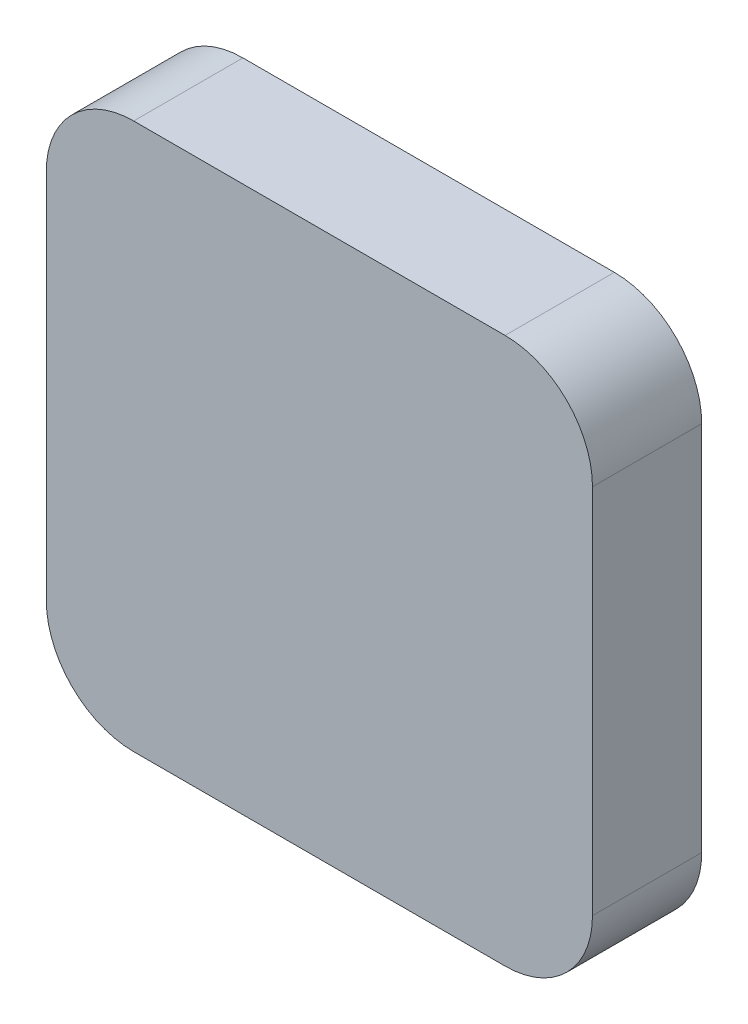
from build123d import *

# Parameters (mm, degrees)
ESQUISSE1_W      = 25
ESQUISSE1_H      = 25
EXTRUSION1_DEPTH = 5
CONG_1_R         = 4


with BuildPart() as part:
    # Esquisse1 → Extrusion1 (new body)
    with BuildSketch(Plane.XY):
        Rectangle(ESQUISSE1_W, ESQUISSE1_H)
    extrude(amount=EXTRUSION1_DEPTH)

    # Cong_1
    cong_1_edges = [part.edges().sort_by_distance(p)[0] for p in [
        (12.5, -12.5, 2.5),
        (-12.5, -12.5, 2.5),
        (-12.5, 12.5, 2.5),
        (12.5, 12.5, 2.5),
    ]]
    fillet(cong_1_edges, radius=CONG_1_R)


solid = part.part
